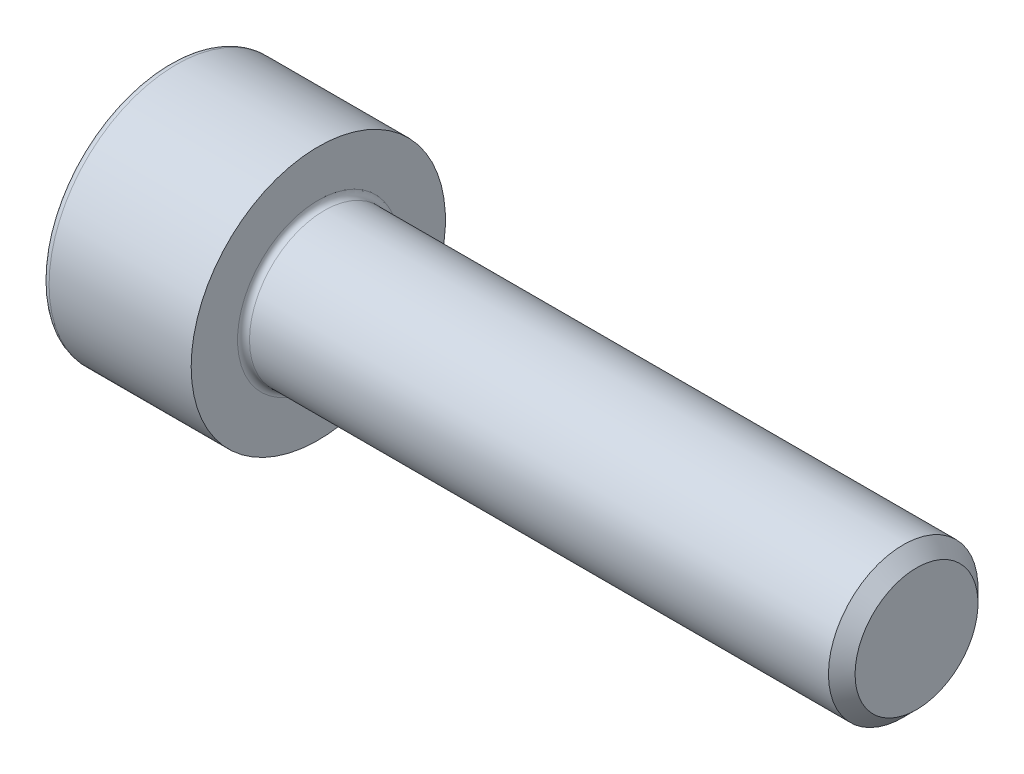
from build123d import *

# Parameters (mm, degrees)
FILLET1_R   = 0.2
FILLET2_R   = 0.25
HEX_2_DEPTH = 2.5


with BuildPart() as part:
    # BodySke → Base-Revolve (revolve)
    with BuildSketch(Plane.XY, mode=Mode.PRIVATE) as base_revolve_sk:
        Polygon((0, 0), (0, 4.25), (5, 4.25), (5, 2.5), (24.555, 2.5), (25, 2.055), (25, 0), align=None)
    revolve(base_revolve_sk.sketch.rotate(Axis((-31.75, 0, 0), (1, 0, 0)), 90), axis=Axis((-31.75, 0, 0), (1, 0, 0)))

    # Fillet1
    fillet1_edges = [part.edges().sort_by_distance(p)[0] for p in [
        (5, 0, -2.5),
    ]]
    fillet(fillet1_edges, radius=FILLET1_R)

    # Fillet2
    fillet2_edges = [part.edges().sort_by_distance(p)[0] for p in [
        (0, 0, -4.25),
    ]]
    fillet(fillet2_edges, radius=FILLET2_R)

    # Sketch2 → Hex-PreBroach (revolve, cut)
    with BuildSketch(Plane.XY, mode=Mode.PRIVATE) as hex_prebroach_sk:
        Polygon((0, 2.042), (2.5, 2.042), (3.67894925, 0), (0, 0), align=None)
    revolve(hex_prebroach_sk.sketch.rotate(Axis((0, 0, 0), (1, 0, 0)), 90), axis=Axis((0, 0, 0), (1, 0, 0)), mode=Mode.SUBTRACT)

    # Sketch3 → Hex 2 (cut)
    with BuildSketch(Plane(origin=(0, 0, 0), x_dir=(0, 0.500000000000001, 0.866025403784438), z_dir=(-1, 0, 0))):
        Polygon((1.17894925, 2.042), (-1.17894925, 2.042), (-2.357898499, 0), (-1.17894925, -2.042), (1.17894925, -2.042), (2.357898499, 0), align=None)
    extrude(amount=-HEX_2_DEPTH, mode=Mode.SUBTRACT)


solid = part.part
